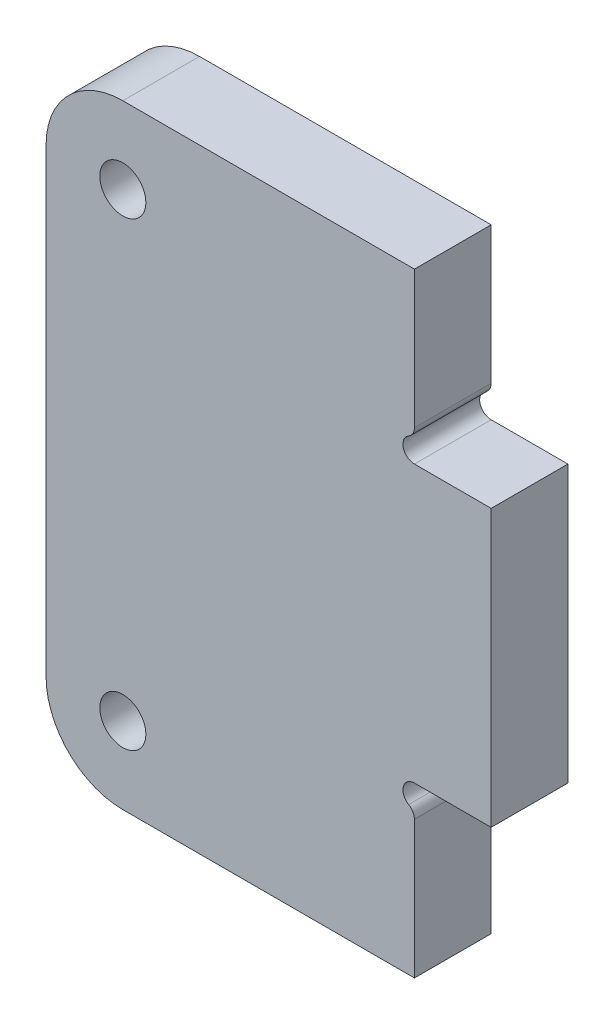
from build123d import *

# Parameters (mm, degrees)
ESQUISSE1_R        = 3
BOSS_EXTRU_1_DEPTH = 10


with BuildPart() as part:
    # Esquisse1 → Boss.-Extru.1 (new body)
    with BuildSketch(Plane.XY):
        with BuildLine():
            Line((28.046558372, -18), (38.046558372, -18))
            Line((38.046558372, -18), (38.046558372, 18))
            Line((38.046558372, 18), (28.046558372, 18))
            ThreePointArc((28.046558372, 18), (26.597669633, 19.111771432), (27.296558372, 20.799038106))
            ThreePointArc((27.296558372, 20.799038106), (27.845596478, 21.348076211), (28.046558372, 22.098076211))
            Line((28.046558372, 22.098076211), (28.046558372, 40))
            Line((28.046558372, 40), (-9.953441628, 40))
            ThreePointArc((-9.953441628, 40), (-17.02450944, 37.071067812), (-19.953441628, 30))
            Line((-19.953441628, 30), (-19.953441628, -30))
            ThreePointArc((-19.953441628, -30), (-17.02450944, -37.071067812), (-9.953441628, -40))
            Line((-9.953441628, -40), (28.046558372, -40))
            Line((28.046558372, -40), (28.046558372, -22.098076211))
            ThreePointArc((28.046558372, -22.098076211), (27.845596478, -21.348076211), (27.296558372, -20.799038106))
            ThreePointArc((27.296558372, -20.799038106), (26.597669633, -19.111771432), (28.046558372, -18))
        make_face()
        with Locations((-9.953441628, -30)):
            Circle(ESQUISSE1_R, mode=Mode.SUBTRACT)
        with Locations((-9.953441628, 30)):
            Circle(ESQUISSE1_R, mode=Mode.SUBTRACT)
    extrude(amount=BOSS_EXTRU_1_DEPTH)


solid = part.part
